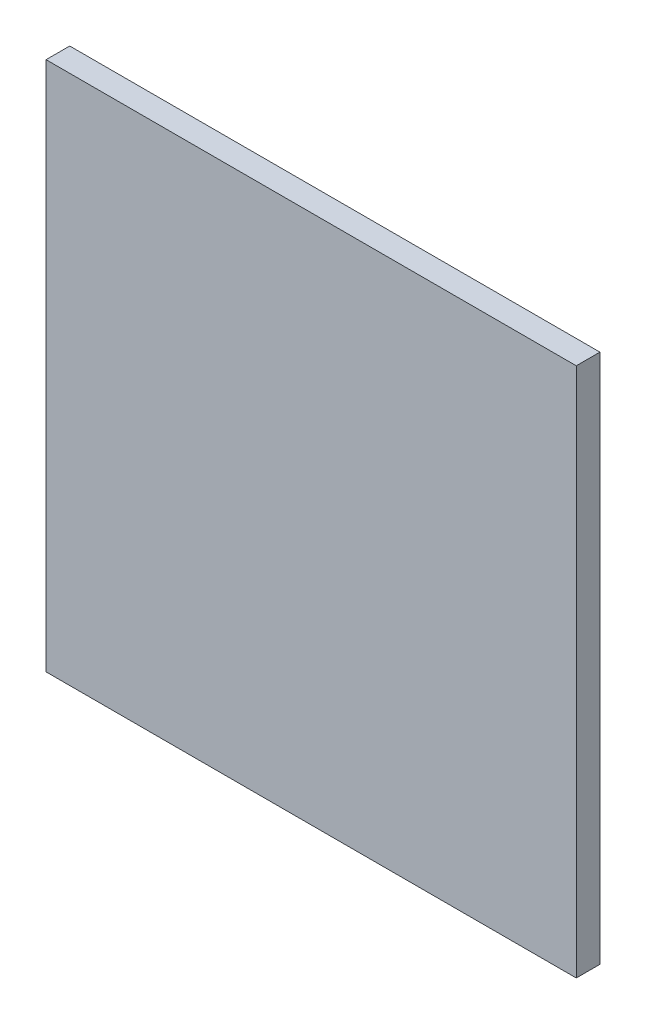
from build123d import *

# Parameters (mm, degrees)
SKETCH1_W           = 71.12
SKETCH1_H           = 71.12
BOSS_EXTRUDE1_DEPTH = 3.175


with BuildPart() as part:
    # Sketch1 → Boss-Extrude1 (new body)
    with BuildSketch(Plane.XY):
        Rectangle(SKETCH1_W, SKETCH1_H)
    extrude(amount=BOSS_EXTRUDE1_DEPTH)


solid = part.part
